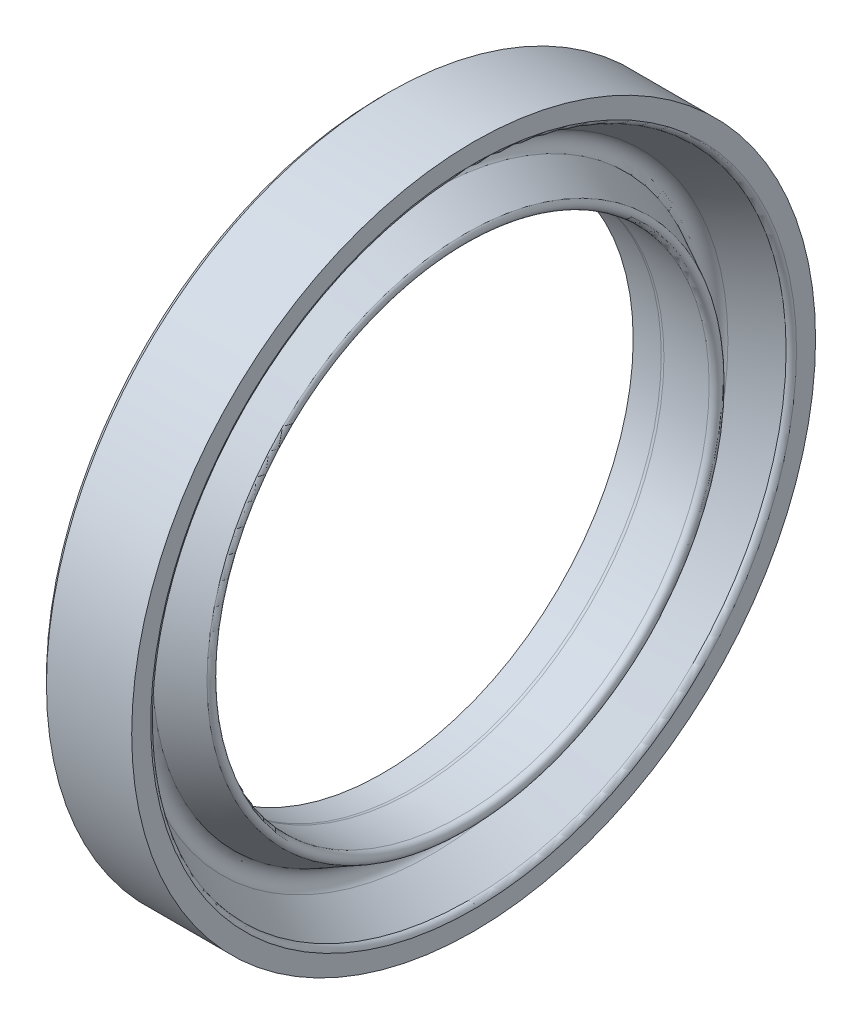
ISO-10303-21;
HEADER;
FILE_DESCRIPTION(('STEP AP214'),'2;1');
FILE_NAME('part.step','',(''),(''),'','','');
FILE_SCHEMA(('AUTOMOTIVE_DESIGN { 1 0 10303 214 1 1 1 1 }'));
ENDSEC;
DATA;
#1=APPLICATION_CONTEXT('core data for automotive mechanical design processes');
#2=APPLICATION_PROTOCOL_DEFINITION('international standard','automotive_design',2000,#1);
#3=PRODUCT_CONTEXT('',#1,'mechanical');
#4=PRODUCT('Part','Part','',(#3));
#5=PRODUCT_RELATED_PRODUCT_CATEGORY('part','',(#4));
#6=PRODUCT_DEFINITION_FORMATION('','',#4);
#7=PRODUCT_DEFINITION_CONTEXT('part definition',#1,'design');
#8=PRODUCT_DEFINITION('design','',#6,#7);
#9=PRODUCT_DEFINITION_SHAPE('','',#8);
#10=(LENGTH_UNIT() NAMED_UNIT(*) SI_UNIT(.MILLI.,.METRE.));
#11=(NAMED_UNIT(*) PLANE_ANGLE_UNIT() SI_UNIT($,.RADIAN.));
#12=(NAMED_UNIT(*) SI_UNIT($,.STERADIAN.) SOLID_ANGLE_UNIT());
#13=UNCERTAINTY_MEASURE_WITH_UNIT(LENGTH_MEASURE(1.E-05),#10,'distance_accuracy_value','');
#14=(GEOMETRIC_REPRESENTATION_CONTEXT(3) GLOBAL_UNCERTAINTY_ASSIGNED_CONTEXT((#13)) GLOBAL_UNIT_ASSIGNED_CONTEXT((#10,
#11,#12)) REPRESENTATION_CONTEXT('',''));
#15=CARTESIAN_POINT('',(0.,0.,0.));
#16=DIRECTION('',(0.,0.,1.));
#17=DIRECTION('',(1.,0.,0.));
#18=AXIS2_PLACEMENT_3D('',#15,#16,#17);
#19=CARTESIAN_POINT('',(-0.394634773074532,0.,0.));
#20=DIRECTION('',(1.,0.,0.));
#21=DIRECTION('',(0.,0.,-1.));
#22=AXIS2_PLACEMENT_3D('',#19,#20,#21);
#23=TOROIDAL_SURFACE('',#22,35.4953832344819,0.649999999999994);
#24=CARTESIAN_POINT('',(-0.324999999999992,0.,0.));
#25=DIRECTION('',(1.,0.,0.));
#26=DIRECTION('',(0.,0.,-1.));
#27=AXIS2_PLACEMENT_3D('',#24,#25,#26);
#28=CIRCLE('',#27,34.8491239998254);
#29=CARTESIAN_POINT('',(-0.324999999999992,0.,-34.8491239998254));
#30=VERTEX_POINT('',#29);
#31=EDGE_CURVE('E10',#30,#30,#28,.T.);
#32=ORIENTED_EDGE('',*,*,#31,.F.);
#33=EDGE_LOOP('',(#32));
#34=FACE_BOUND('',#33,.T.);
#35=CARTESIAN_POINT('',(0.249999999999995,0.,0.));
#36=DIRECTION('',(1.,0.,0.));
#37=DIRECTION('',(0.,0.,-1.));
#38=AXIS2_PLACEMENT_3D('',#35,#36,#37);
#39=CIRCLE('',#38,35.4120405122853);
#40=CARTESIAN_POINT('',(0.249999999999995,0.,-35.4120405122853));
#41=VERTEX_POINT('',#40);
#42=EDGE_CURVE('E69',#41,#41,#39,.T.);
#43=ORIENTED_EDGE('',*,*,#42,.T.);
#44=EDGE_LOOP('',(#43));
#45=FACE_BOUND('',#44,.T.);
#46=ADVANCED_FACE('F29',(#34,#45),#23,.T.);
#47=CARTESIAN_POINT('',(-0.324999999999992,0.,0.));
#48=DIRECTION('',(1.,0.,0.));
#49=DIRECTION('',(0.,0.,-1.));
#50=AXIS2_PLACEMENT_3D('',#47,#48,#49);
#51=CONICAL_SURFACE('',#50,34.8491239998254,0.523598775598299);
#52=CARTESIAN_POINT('',(-4.37410515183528,0.,0.));
#53=DIRECTION('',(1.,0.,0.));
#54=DIRECTION('',(0.,0.,-1.));
#55=AXIS2_PLACEMENT_3D('',#52,#53,#54);
#56=CIRCLE('',#55,32.5113720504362);
#57=CARTESIAN_POINT('',(-4.37410515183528,0.,-32.5113720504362));
#58=VERTEX_POINT('',#57);
#59=EDGE_CURVE('E35',#58,#58,#56,.T.);
#60=ORIENTED_EDGE('',*,*,#59,.F.);
#61=EDGE_LOOP('',(#60));
#62=FACE_BOUND('',#61,.T.);
#63=ORIENTED_EDGE('',*,*,#31,.T.);
#64=EDGE_LOOP('',(#63));
#65=FACE_BOUND('',#64,.T.);
#66=ADVANCED_FACE('F130',(#62,#65),#51,.F.);
#67=CARTESIAN_POINT('',(-3.72410515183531,0.,0.));
#68=DIRECTION('',(1.,0.,0.));
#69=DIRECTION('',(0.,0.,-1.));
#70=AXIS2_PLACEMENT_3D('',#67,#68,#69);
#71=TOROIDAL_SURFACE('',#70,31.3855390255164,1.29999999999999);
#72=CARTESIAN_POINT('',(-4.55972904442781,0.,0.));
#73=DIRECTION('',(1.,0.,0.));
#74=DIRECTION('',(0.,0.,-1.));
#75=AXIS2_PLACEMENT_3D('',#72,#73,#74);
#76=CIRCLE('',#75,30.3896812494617);
#77=CARTESIAN_POINT('',(-4.55972904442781,0.,-30.3896812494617));
#78=VERTEX_POINT('',#77);
#79=EDGE_CURVE('E39',#78,#78,#76,.T.);
#80=ORIENTED_EDGE('',*,*,#79,.F.);
#81=EDGE_LOOP('',(#80));
#82=FACE_BOUND('',#81,.T.);
#83=ORIENTED_EDGE('',*,*,#59,.T.);
#84=EDGE_LOOP('',(#83));
#85=FACE_BOUND('',#84,.T.);
#86=ADVANCED_FACE('F125',(#82,#85),#71,.F.);
#87=CARTESIAN_POINT('',(-4.55972904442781,0.,0.));
#88=DIRECTION('',(-1.,0.,0.));
#89=DIRECTION('',(0.,0.,1.));
#90=AXIS2_PLACEMENT_3D('',#87,#88,#89);
#91=CONICAL_SURFACE('',#90,30.3896812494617,0.478196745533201);
#92=CARTESIAN_POINT('',(-0.636042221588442,0.,0.));
#93=DIRECTION('',(1.,0.,0.));
#94=DIRECTION('',(0.,0.,-1.));
#95=AXIS2_PLACEMENT_3D('',#92,#93,#94);
#96=CIRCLE('',#95,28.3559520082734);
#97=CARTESIAN_POINT('',(-0.636042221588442,0.,-28.3559520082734));
#98=VERTEX_POINT('',#97);
#99=EDGE_CURVE('E43',#98,#98,#96,.T.);
#100=ORIENTED_EDGE('',*,*,#99,.F.);
#101=EDGE_LOOP('',(#100));
#102=FACE_BOUND('',#101,.T.);
#103=ORIENTED_EDGE('',*,*,#79,.T.);
#104=EDGE_LOOP('',(#103));
#105=FACE_BOUND('',#104,.T.);
#106=ADVANCED_FACE('F119',(#102,#105),#91,.T.);
#107=CARTESIAN_POINT('',(-1.03583740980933,0.,0.));
#108=DIRECTION('',(1.,0.,0.));
#109=DIRECTION('',(0.,0.,-1.));
#110=AXIS2_PLACEMENT_3D('',#107,#108,#109);
#111=TOROIDAL_SURFACE('',#110,27.8794946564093,0.621970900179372);
#112=CARTESIAN_POINT('',(-1.19681532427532,0.,0.));
#113=DIRECTION('',(1.,0.,0.));
#114=DIRECTION('',(0.,0.,-1.));
#115=AXIS2_PLACEMENT_3D('',#112,#113,#114);
#116=CIRCLE('',#115,27.2787169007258);
#117=CARTESIAN_POINT('',(-1.19681532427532,0.,-27.2787169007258));
#118=VERTEX_POINT('',#117);
#119=EDGE_CURVE('E48',#118,#118,#116,.T.);
#120=ORIENTED_EDGE('',*,*,#119,.F.);
#121=EDGE_LOOP('',(#120));
#122=FACE_BOUND('',#121,.T.);
#123=ORIENTED_EDGE('',*,*,#99,.T.);
#124=EDGE_LOOP('',(#123));
#125=FACE_BOUND('',#124,.T.);
#126=ADVANCED_FACE('F113',(#122,#125),#111,.T.);
#127=CARTESIAN_POINT('',(-1.19681532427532,0.,0.));
#128=DIRECTION('',(-1.,0.,0.));
#129=DIRECTION('',(0.,0.,1.));
#130=AXIS2_PLACEMENT_3D('',#127,#128,#129);
#131=CONICAL_SURFACE('',#130,27.2787169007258,0.0344338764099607);
#132=CARTESIAN_POINT('',(-6.33468348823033,0.,0.));
#133=DIRECTION('',(1.,0.,0.));
#134=DIRECTION('',(0.,0.,-1.));
#135=AXIS2_PLACEMENT_3D('',#132,#133,#134);
#136=CIRCLE('',#135,27.4557035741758);
#137=CARTESIAN_POINT('',(-6.33468348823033,0.,-27.4557035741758));
#138=VERTEX_POINT('',#137);
#139=EDGE_CURVE('E51',#138,#138,#136,.T.);
#140=ORIENTED_EDGE('',*,*,#139,.F.);
#141=EDGE_LOOP('',(#140));
#142=FACE_BOUND('',#141,.T.);
#143=ORIENTED_EDGE('',*,*,#119,.T.);
#144=EDGE_LOOP('',(#143));
#145=FACE_BOUND('',#144,.T.);
#146=ADVANCED_FACE('F107',(#142,#145),#131,.F.);
#147=CARTESIAN_POINT('',(-6.67114824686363,0.,0.));
#148=DIRECTION('',(1.,0.,0.));
#149=DIRECTION('',(0.,0.,-1.));
#150=AXIS2_PLACEMENT_3D('',#147,#148,#149);
#151=TOROIDAL_SURFACE('',#150,26.2,1.3);
#152=CARTESIAN_POINT('',(-6.67114824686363,0.,0.));
#153=DIRECTION('',(1.,0.,0.));
#154=DIRECTION('',(0.,0.,-1.));
#155=AXIS2_PLACEMENT_3D('',#152,#153,#154);
#156=CIRCLE('',#155,27.5);
#157=CARTESIAN_POINT('',(-6.67114824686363,0.,-27.5));
#158=VERTEX_POINT('',#157);
#159=EDGE_CURVE('E54',#158,#158,#156,.T.);
#160=ORIENTED_EDGE('',*,*,#159,.F.);
#161=EDGE_LOOP('',(#160));
#162=FACE_BOUND('',#161,.T.);
#163=ORIENTED_EDGE('',*,*,#139,.T.);
#164=EDGE_LOOP('',(#163));
#165=FACE_BOUND('',#164,.T.);
#166=ADVANCED_FACE('F101',(#162,#165),#151,.F.);
#167=CARTESIAN_POINT('',(2.43404063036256,0.,0.));
#168=DIRECTION('',(1.,0.,0.));
#169=DIRECTION('',(0.,0.,-1.));
#170=AXIS2_PLACEMENT_3D('',#167,#168,#169);
#171=CYLINDRICAL_SURFACE('',#170,27.5);
#172=CARTESIAN_POINT('',(-9.75000000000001,0.,0.));
#173=DIRECTION('',(1.,0.,0.));
#174=DIRECTION('',(0.,0.,-1.));
#175=AXIS2_PLACEMENT_3D('',#172,#173,#174);
#176=CIRCLE('',#175,27.5);
#177=CARTESIAN_POINT('',(-9.75000000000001,0.,-27.5));
#178=VERTEX_POINT('',#177);
#179=EDGE_CURVE('E57',#178,#178,#176,.T.);
#180=ORIENTED_EDGE('',*,*,#179,.F.);
#181=EDGE_LOOP('',(#180));
#182=FACE_BOUND('',#181,.T.);
#183=ORIENTED_EDGE('',*,*,#159,.T.);
#184=EDGE_LOOP('',(#183));
#185=FACE_BOUND('',#184,.T.);
#186=ADVANCED_FACE('F95',(#182,#185),#171,.F.);
#187=CARTESIAN_POINT('',(-9.75000000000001,-36.85,0.));
#188=DIRECTION('',(1.,0.,0.));
#189=DIRECTION('',(0.,0.,-1.));
#190=AXIS2_PLACEMENT_3D('',#187,#188,#189);
#191=PLANE('',#190);
#192=CARTESIAN_POINT('',(-9.75000000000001,0.,0.));
#193=DIRECTION('',(1.,0.,0.));
#194=DIRECTION('',(0.,0.,-1.));
#195=AXIS2_PLACEMENT_3D('',#192,#193,#194);
#196=CIRCLE('',#195,36.85);
#197=CARTESIAN_POINT('',(-9.75000000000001,0.,-36.85));
#198=VERTEX_POINT('',#197);
#199=EDGE_CURVE('E60',#198,#198,#196,.T.);
#200=ORIENTED_EDGE('',*,*,#199,.F.);
#201=EDGE_LOOP('',(#200));
#202=FACE_BOUND('',#201,.T.);
#203=ORIENTED_EDGE('',*,*,#179,.T.);
#204=EDGE_LOOP('',(#203));
#205=FACE_BOUND('',#204,.T.);
#206=ADVANCED_FACE('F89',(#202,#205),#191,.F.);
#207=CARTESIAN_POINT('',(-9.75000000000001,0.,0.));
#208=DIRECTION('',(1.,0.,0.));
#209=DIRECTION('',(0.,0.,-1.));
#210=AXIS2_PLACEMENT_3D('',#207,#208,#209);
#211=CONICAL_SURFACE('',#210,36.85,0.785398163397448);
#212=CARTESIAN_POINT('',(-9.09999999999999,0.,0.));
#213=DIRECTION('',(1.,0.,0.));
#214=DIRECTION('',(0.,0.,-1.));
#215=AXIS2_PLACEMENT_3D('',#212,#213,#214);
#216=CIRCLE('',#215,37.5);
#217=CARTESIAN_POINT('',(-9.09999999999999,0.,-37.5));
#218=VERTEX_POINT('',#217);
#219=EDGE_CURVE('E63',#218,#218,#216,.T.);
#220=ORIENTED_EDGE('',*,*,#219,.F.);
#221=EDGE_LOOP('',(#220));
#222=FACE_BOUND('',#221,.T.);
#223=ORIENTED_EDGE('',*,*,#199,.T.);
#224=EDGE_LOOP('',(#223));
#225=FACE_BOUND('',#224,.T.);
#226=ADVANCED_FACE('F83',(#222,#225),#211,.T.);
#227=CARTESIAN_POINT('',(2.43404063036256,0.,0.));
#228=DIRECTION('',(1.,0.,0.));
#229=DIRECTION('',(0.,0.,-1.));
#230=AXIS2_PLACEMENT_3D('',#227,#228,#229);
#231=CYLINDRICAL_SURFACE('',#230,37.5);
#232=CARTESIAN_POINT('',(0.249999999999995,0.,0.));
#233=DIRECTION('',(1.,0.,0.));
#234=DIRECTION('',(0.,0.,-1.));
#235=AXIS2_PLACEMENT_3D('',#232,#233,#234);
#236=CIRCLE('',#235,37.5);
#237=CARTESIAN_POINT('',(0.249999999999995,0.,-37.5));
#238=VERTEX_POINT('',#237);
#239=EDGE_CURVE('E66',#238,#238,#236,.T.);
#240=ORIENTED_EDGE('',*,*,#239,.F.);
#241=EDGE_LOOP('',(#240));
#242=FACE_BOUND('',#241,.T.);
#243=ORIENTED_EDGE('',*,*,#219,.T.);
#244=EDGE_LOOP('',(#243));
#245=FACE_BOUND('',#244,.T.);
#246=ADVANCED_FACE('F77',(#242,#245),#231,.T.);
#247=CARTESIAN_POINT('',(0.249999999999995,-37.5,0.));
#248=DIRECTION('',(-1.,0.,0.));
#249=DIRECTION('',(0.,0.,1.));
#250=AXIS2_PLACEMENT_3D('',#247,#248,#249);
#251=PLANE('',#250);
#252=ORIENTED_EDGE('',*,*,#42,.F.);
#253=EDGE_LOOP('',(#252));
#254=FACE_BOUND('',#253,.T.);
#255=ORIENTED_EDGE('',*,*,#239,.T.);
#256=EDGE_LOOP('',(#255));
#257=FACE_BOUND('',#256,.T.);
#258=ADVANCED_FACE('F74',(#254,#257),#251,.F.);
#259=CLOSED_SHELL('',(#46,#66,#86,#106,#126,#146,#166,#186,#206,#226,#246,#258));
#260=MANIFOLD_SOLID_BREP('B2',#259);
#261=ADVANCED_BREP_SHAPE_REPRESENTATION('',(#18,#260),#14);
#262=SHAPE_DEFINITION_REPRESENTATION(#9,#261);
ENDSEC;
END-ISO-10303-21;
